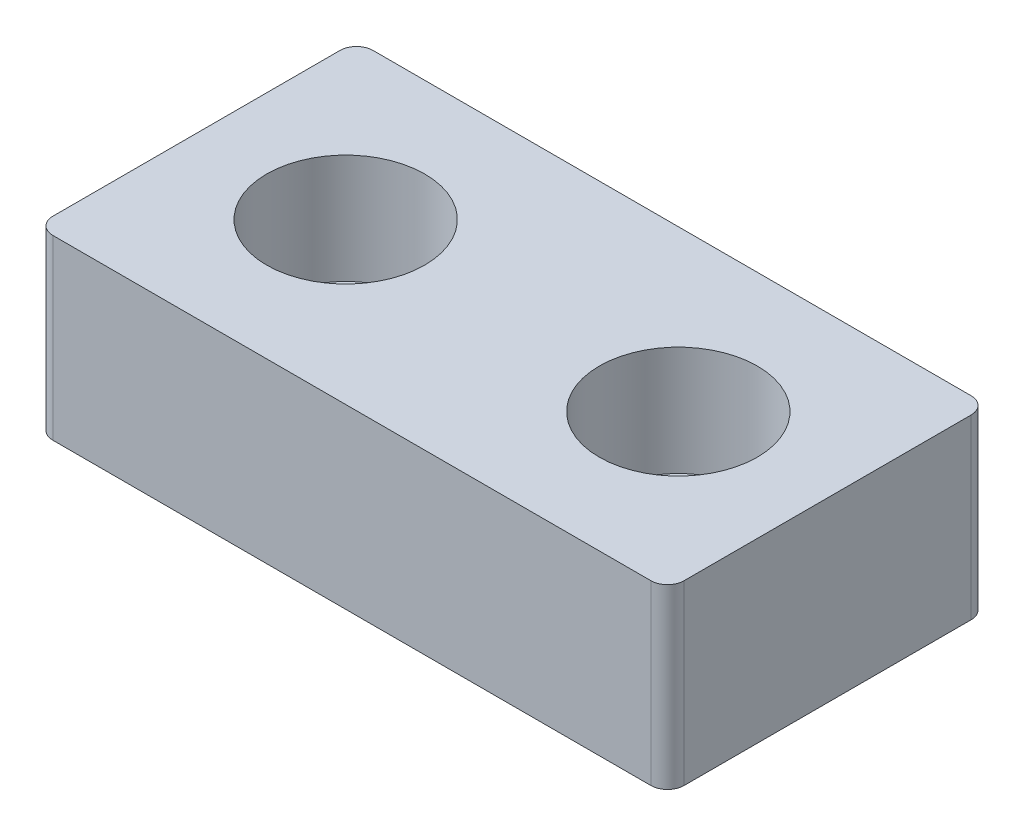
ISO-10303-21;
HEADER;
FILE_DESCRIPTION(('STEP AP214'),'2;1');
FILE_NAME('part.step','',(''),(''),'','','');
FILE_SCHEMA(('AUTOMOTIVE_DESIGN { 1 0 10303 214 1 1 1 1 }'));
ENDSEC;
DATA;
#1=APPLICATION_CONTEXT('core data for automotive mechanical design processes');
#2=APPLICATION_PROTOCOL_DEFINITION('international standard','automotive_design',2000,#1);
#3=PRODUCT_CONTEXT('',#1,'mechanical');
#4=PRODUCT('Part','Part','',(#3));
#5=PRODUCT_RELATED_PRODUCT_CATEGORY('part','',(#4));
#6=PRODUCT_DEFINITION_FORMATION('','',#4);
#7=PRODUCT_DEFINITION_CONTEXT('part definition',#1,'design');
#8=PRODUCT_DEFINITION('design','',#6,#7);
#9=PRODUCT_DEFINITION_SHAPE('','',#8);
#10=(LENGTH_UNIT() NAMED_UNIT(*) SI_UNIT(.MILLI.,.METRE.));
#11=(NAMED_UNIT(*) PLANE_ANGLE_UNIT() SI_UNIT($,.RADIAN.));
#12=(NAMED_UNIT(*) SI_UNIT($,.STERADIAN.) SOLID_ANGLE_UNIT());
#13=UNCERTAINTY_MEASURE_WITH_UNIT(LENGTH_MEASURE(1.E-05),#10,'distance_accuracy_value','');
#14=(GEOMETRIC_REPRESENTATION_CONTEXT(3) GLOBAL_UNCERTAINTY_ASSIGNED_CONTEXT((#13)) GLOBAL_UNIT_ASSIGNED_CONTEXT((#10,
#11,#12)) REPRESENTATION_CONTEXT('',''));
#15=CARTESIAN_POINT('',(0.,0.,0.));
#16=DIRECTION('',(0.,0.,1.));
#17=DIRECTION('',(1.,0.,0.));
#18=AXIS2_PLACEMENT_3D('',#15,#16,#17);
#19=CARTESIAN_POINT('',(-64.646549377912,6.30402599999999,-34.7055606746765));
#20=DIRECTION('',(1.,0.,0.));
#21=DIRECTION('',(0.,0.,-1.));
#22=AXIS2_PLACEMENT_3D('',#19,#20,#21);
#23=PLANE('',#22);
#24=DIRECTION('',(0.,0.,1.));
#25=VECTOR('',#24,1.);
#26=CARTESIAN_POINT('',(-64.646549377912,6.30402599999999,-34.7055606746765));
#27=LINE('',#26,#25);
#28=CARTESIAN_POINT('',(-64.646549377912,6.30402599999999,-48.618835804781));
#29=VERTEX_POINT('',#28);
#30=CARTESIAN_POINT('',(-64.646549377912,6.30402599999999,-35.4675606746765));
#31=VERTEX_POINT('',#30);
#32=EDGE_CURVE('E119',#29,#31,#27,.T.);
#33=ORIENTED_EDGE('',*,*,#32,.F.);
#34=DIRECTION('',(0.,-1.,0.));
#35=VECTOR('',#34,1.);
#36=CARTESIAN_POINT('',(-64.646549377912,6.30402599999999,-48.618835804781));
#37=LINE('',#36,#35);
#38=CARTESIAN_POINT('',(-64.646549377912,-1.82397400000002,-48.618835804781));
#39=VERTEX_POINT('',#38);
#40=EDGE_CURVE('E104',#29,#39,#37,.T.);
#41=ORIENTED_EDGE('',*,*,#40,.T.);
#42=DIRECTION('',(0.,0.,1.));
#43=VECTOR('',#42,1.);
#44=CARTESIAN_POINT('',(-64.646549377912,-1.82397400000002,-34.7055606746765));
#45=LINE('',#44,#43);
#46=CARTESIAN_POINT('',(-64.646549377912,-1.82397400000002,-35.4675606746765));
#47=VERTEX_POINT('',#46);
#48=EDGE_CURVE('E116',#39,#47,#45,.T.);
#49=ORIENTED_EDGE('',*,*,#48,.T.);
#50=DIRECTION('',(0.,-1.,0.));
#51=VECTOR('',#50,1.);
#52=CARTESIAN_POINT('',(-64.646549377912,6.30402599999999,-35.4675606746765));
#53=LINE('',#52,#51);
#54=EDGE_CURVE('E121',#47,#31,#53,.F.);
#55=ORIENTED_EDGE('',*,*,#54,.T.);
#56=EDGE_LOOP('',(#33,#41,#49,#55));
#57=FACE_BOUND('',#56,.T.);
#58=ADVANCED_FACE('F32',(#57),#23,.F.);
#59=CARTESIAN_POINT('',(-35.7234313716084,6.30402599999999,-34.7055606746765));
#60=DIRECTION('',(0.,0.,-1.));
#61=DIRECTION('',(-1.,0.,0.));
#62=AXIS2_PLACEMENT_3D('',#59,#60,#61);
#63=PLANE('',#62);
#64=DIRECTION('',(1.,0.,0.));
#65=VECTOR('',#64,1.);
#66=CARTESIAN_POINT('',(-35.7234313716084,-1.82397400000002,-34.7055606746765));
#67=LINE('',#66,#65);
#68=CARTESIAN_POINT('',(-63.884549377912,-1.82397400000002,-34.7055606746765));
#69=VERTEX_POINT('',#68);
#70=CARTESIAN_POINT('',(-36.4854313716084,-1.82397400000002,-34.7055606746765));
#71=VERTEX_POINT('',#70);
#72=EDGE_CURVE('E125',#69,#71,#67,.T.);
#73=ORIENTED_EDGE('',*,*,#72,.T.);
#74=DIRECTION('',(0.,-1.,0.));
#75=VECTOR('',#74,1.);
#76=CARTESIAN_POINT('',(-36.4854313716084,6.30402599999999,-34.7055606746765));
#77=LINE('',#76,#75);
#78=CARTESIAN_POINT('',(-36.4854313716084,6.30402599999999,-34.7055606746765));
#79=VERTEX_POINT('',#78);
#80=EDGE_CURVE('E11',#71,#79,#77,.F.);
#81=ORIENTED_EDGE('',*,*,#80,.T.);
#82=DIRECTION('',(1.,0.,0.));
#83=VECTOR('',#82,1.);
#84=CARTESIAN_POINT('',(-35.7234313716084,6.30402599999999,-34.7055606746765));
#85=LINE('',#84,#83);
#86=CARTESIAN_POINT('',(-63.884549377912,6.30402599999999,-34.7055606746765));
#87=VERTEX_POINT('',#86);
#88=EDGE_CURVE('E165',#87,#79,#85,.T.);
#89=ORIENTED_EDGE('',*,*,#88,.F.);
#90=DIRECTION('',(0.,-1.,0.));
#91=VECTOR('',#90,1.);
#92=CARTESIAN_POINT('',(-63.884549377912,6.30402599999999,-34.7055606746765));
#93=LINE('',#92,#91);
#94=EDGE_CURVE('E41',#87,#69,#93,.T.);
#95=ORIENTED_EDGE('',*,*,#94,.T.);
#96=EDGE_LOOP('',(#73,#81,#89,#95));
#97=FACE_BOUND('',#96,.T.);
#98=ADVANCED_FACE('F163',(#97),#63,.F.);
#99=CARTESIAN_POINT('',(-35.7234313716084,6.30402599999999,-34.7055606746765));
#100=DIRECTION('',(-1.,0.,0.));
#101=DIRECTION('',(0.,0.,1.));
#102=AXIS2_PLACEMENT_3D('',#99,#100,#101);
#103=PLANE('',#102);
#104=DIRECTION('',(0.,0.,-1.));
#105=VECTOR('',#104,1.);
#106=CARTESIAN_POINT('',(-35.7234313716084,-1.82397400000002,-34.7055606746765));
#107=LINE('',#106,#105);
#108=CARTESIAN_POINT('',(-35.7234313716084,-1.82397400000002,-35.4675606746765));
#109=VERTEX_POINT('',#108);
#110=CARTESIAN_POINT('',(-35.7234313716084,-1.82397400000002,-48.6188358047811));
#111=VERTEX_POINT('',#110);
#112=EDGE_CURVE('E129',#109,#111,#107,.T.);
#113=ORIENTED_EDGE('',*,*,#112,.T.);
#114=DIRECTION('',(0.,-1.,0.));
#115=VECTOR('',#114,1.);
#116=CARTESIAN_POINT('',(-35.7234313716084,6.30402599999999,-48.6188358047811));
#117=LINE('',#116,#115);
#118=CARTESIAN_POINT('',(-35.7234313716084,6.30402599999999,-48.6188358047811));
#119=VERTEX_POINT('',#118);
#120=EDGE_CURVE('E49',#111,#119,#117,.F.);
#121=ORIENTED_EDGE('',*,*,#120,.T.);
#122=DIRECTION('',(0.,0.,-1.));
#123=VECTOR('',#122,1.);
#124=CARTESIAN_POINT('',(-35.7234313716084,6.30402599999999,-34.7055606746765));
#125=LINE('',#124,#123);
#126=CARTESIAN_POINT('',(-35.7234313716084,6.30402599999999,-35.4675606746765));
#127=VERTEX_POINT('',#126);
#128=EDGE_CURVE('E173',#127,#119,#125,.T.);
#129=ORIENTED_EDGE('',*,*,#128,.F.);
#130=DIRECTION('',(0.,-1.,0.));
#131=VECTOR('',#130,1.);
#132=CARTESIAN_POINT('',(-35.7234313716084,6.30402599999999,-35.4675606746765));
#133=LINE('',#132,#131);
#134=EDGE_CURVE('E155',#127,#109,#133,.T.);
#135=ORIENTED_EDGE('',*,*,#134,.T.);
#136=EDGE_LOOP('',(#113,#121,#129,#135));
#137=FACE_BOUND('',#136,.T.);
#138=ADVANCED_FACE('F172',(#137),#103,.F.);
#139=CARTESIAN_POINT('',(-35.7234313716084,6.30402599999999,-49.3808358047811));
#140=DIRECTION('',(0.,0.,1.));
#141=DIRECTION('',(1.,0.,0.));
#142=AXIS2_PLACEMENT_3D('',#139,#140,#141);
#143=PLANE('',#142);
#144=DIRECTION('',(-1.,0.,0.));
#145=VECTOR('',#144,1.);
#146=CARTESIAN_POINT('',(-35.7234313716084,-1.82397400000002,-49.3808358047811));
#147=LINE('',#146,#145);
#148=CARTESIAN_POINT('',(-36.4854313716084,-1.82397400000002,-49.3808358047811));
#149=VERTEX_POINT('',#148);
#150=CARTESIAN_POINT('',(-63.884549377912,-1.82397400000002,-49.380835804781));
#151=VERTEX_POINT('',#150);
#152=EDGE_CURVE('E138',#149,#151,#147,.T.);
#153=ORIENTED_EDGE('',*,*,#152,.T.);
#154=DIRECTION('',(0.,-1.,0.));
#155=VECTOR('',#154,1.);
#156=CARTESIAN_POINT('',(-63.884549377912,6.30402599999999,-49.380835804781));
#157=LINE('',#156,#155);
#158=CARTESIAN_POINT('',(-63.884549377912,6.30402599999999,-49.380835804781));
#159=VERTEX_POINT('',#158);
#160=EDGE_CURVE('E105',#151,#159,#157,.F.);
#161=ORIENTED_EDGE('',*,*,#160,.T.);
#162=DIRECTION('',(-1.,0.,0.));
#163=VECTOR('',#162,1.);
#164=CARTESIAN_POINT('',(-35.7234313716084,6.30402599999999,-49.3808358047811));
#165=LINE('',#164,#163);
#166=CARTESIAN_POINT('',(-36.4854313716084,6.30402599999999,-49.3808358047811));
#167=VERTEX_POINT('',#166);
#168=EDGE_CURVE('E134',#167,#159,#165,.T.);
#169=ORIENTED_EDGE('',*,*,#168,.F.);
#170=DIRECTION('',(0.,-1.,0.));
#171=VECTOR('',#170,1.);
#172=CARTESIAN_POINT('',(-36.4854313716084,6.30402599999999,-49.3808358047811));
#173=LINE('',#172,#171);
#174=EDGE_CURVE('E110',#167,#149,#173,.T.);
#175=ORIENTED_EDGE('',*,*,#174,.T.);
#176=EDGE_LOOP('',(#153,#161,#169,#175));
#177=FACE_BOUND('',#176,.T.);
#178=ADVANCED_FACE('F202',(#177),#143,.F.);
#179=CARTESIAN_POINT('',(0.,6.30402599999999,0.));
#180=DIRECTION('',(0.,1.,0.));
#181=DIRECTION('',(0.,0.,1.));
#182=AXIS2_PLACEMENT_3D('',#179,#180,#181);
#183=PLANE('',#182);
#184=CARTESIAN_POINT('',(-57.8049903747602,6.30402599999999,-42.0431982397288));
#185=DIRECTION('',(0.,1.,0.));
#186=DIRECTION('',(0.,0.,1.));
#187=AXIS2_PLACEMENT_3D('',#184,#185,#186);
#188=CIRCLE('',#187,3.6195);
#189=CARTESIAN_POINT('',(-57.8049903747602,6.30402599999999,-38.4236982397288));
#190=VERTEX_POINT('',#189);
#191=EDGE_CURVE('E193',#190,#190,#188,.T.);
#192=ORIENTED_EDGE('',*,*,#191,.F.);
#193=EDGE_LOOP('',(#192));
#194=FACE_BOUND('',#193,.T.);
#195=CARTESIAN_POINT('',(-42.5649903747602,6.30402599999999,-42.0431982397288));
#196=DIRECTION('',(0.,1.,0.));
#197=DIRECTION('',(0.,0.,1.));
#198=AXIS2_PLACEMENT_3D('',#195,#196,#197);
#199=CIRCLE('',#198,3.6195);
#200=CARTESIAN_POINT('',(-42.5649903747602,6.30402599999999,-38.4236982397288));
#201=VERTEX_POINT('',#200);
#202=EDGE_CURVE('E184',#201,#201,#199,.T.);
#203=ORIENTED_EDGE('',*,*,#202,.F.);
#204=EDGE_LOOP('',(#203));
#205=FACE_BOUND('',#204,.T.);
#206=ORIENTED_EDGE('',*,*,#168,.T.);
#207=CARTESIAN_POINT('',(-63.884549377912,6.30402599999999,-48.618835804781));
#208=DIRECTION('',(0.,1.,0.));
#209=DIRECTION('',(0.,0.,1.));
#210=AXIS2_PLACEMENT_3D('',#207,#208,#209);
#211=CIRCLE('',#210,0.762);
#212=EDGE_CURVE('E153',#159,#29,#211,.T.);
#213=ORIENTED_EDGE('',*,*,#212,.T.);
#214=ORIENTED_EDGE('',*,*,#32,.T.);
#215=CARTESIAN_POINT('',(-63.884549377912,6.30402599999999,-35.4675606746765));
#216=DIRECTION('',(0.,1.,0.));
#217=DIRECTION('',(0.,0.,1.));
#218=AXIS2_PLACEMENT_3D('',#215,#216,#217);
#219=CIRCLE('',#218,0.762);
#220=EDGE_CURVE('E148',#31,#87,#219,.T.);
#221=ORIENTED_EDGE('',*,*,#220,.T.);
#222=ORIENTED_EDGE('',*,*,#88,.T.);
#223=CARTESIAN_POINT('',(-36.4854313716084,6.30402599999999,-35.4675606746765));
#224=DIRECTION('',(0.,1.,0.));
#225=DIRECTION('',(0.,0.,1.));
#226=AXIS2_PLACEMENT_3D('',#223,#224,#225);
#227=CIRCLE('',#226,0.762);
#228=EDGE_CURVE('E56',#79,#127,#227,.T.);
#229=ORIENTED_EDGE('',*,*,#228,.T.);
#230=ORIENTED_EDGE('',*,*,#128,.T.);
#231=CARTESIAN_POINT('',(-36.4854313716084,6.30402599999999,-48.6188358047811));
#232=DIRECTION('',(0.,1.,0.));
#233=DIRECTION('',(0.,0.,1.));
#234=AXIS2_PLACEMENT_3D('',#231,#232,#233);
#235=CIRCLE('',#234,0.762);
#236=EDGE_CURVE('E151',#119,#167,#235,.T.);
#237=ORIENTED_EDGE('',*,*,#236,.T.);
#238=EDGE_LOOP('',(#206,#213,#214,#221,#222,#229,#230,#237));
#239=FACE_BOUND('',#238,.T.);
#240=ADVANCED_FACE('F199',(#194,#205,#239),#183,.T.);
#241=CARTESIAN_POINT('',(0.,-1.82397400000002,0.));
#242=DIRECTION('',(0.,1.,0.));
#243=DIRECTION('',(0.,0.,1.));
#244=AXIS2_PLACEMENT_3D('',#241,#242,#243);
#245=PLANE('',#244);
#246=CARTESIAN_POINT('',(-57.8049903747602,-1.82397400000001,-42.0431982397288));
#247=DIRECTION('',(0.,1.,0.));
#248=DIRECTION('',(0.,0.,1.));
#249=AXIS2_PLACEMENT_3D('',#246,#247,#248);
#250=CIRCLE('',#249,2.15);
#251=CARTESIAN_POINT('',(-57.8049903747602,-1.82397400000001,-39.8931982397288));
#252=VERTEX_POINT('',#251);
#253=EDGE_CURVE('E36',#252,#252,#250,.T.);
#254=ORIENTED_EDGE('',*,*,#253,.T.);
#255=EDGE_LOOP('',(#254));
#256=FACE_BOUND('',#255,.T.);
#257=CARTESIAN_POINT('',(-42.5649903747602,-1.82397400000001,-42.0431982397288));
#258=DIRECTION('',(0.,1.,0.));
#259=DIRECTION('',(0.,0.,1.));
#260=AXIS2_PLACEMENT_3D('',#257,#258,#259);
#261=CIRCLE('',#260,2.15);
#262=CARTESIAN_POINT('',(-42.5649903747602,-1.82397400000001,-39.8931982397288));
#263=VERTEX_POINT('',#262);
#264=EDGE_CURVE('E126',#263,#263,#261,.T.);
#265=ORIENTED_EDGE('',*,*,#264,.T.);
#266=EDGE_LOOP('',(#265));
#267=FACE_BOUND('',#266,.T.);
#268=ORIENTED_EDGE('',*,*,#48,.F.);
#269=CARTESIAN_POINT('',(-63.884549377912,-1.82397400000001,-48.618835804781));
#270=DIRECTION('',(0.,1.,0.));
#271=DIRECTION('',(0.,0.,1.));
#272=AXIS2_PLACEMENT_3D('',#269,#270,#271);
#273=CIRCLE('',#272,0.762);
#274=EDGE_CURVE('E100',#39,#151,#273,.F.);
#275=ORIENTED_EDGE('',*,*,#274,.T.);
#276=ORIENTED_EDGE('',*,*,#152,.F.);
#277=CARTESIAN_POINT('',(-36.4854313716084,-1.82397400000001,-48.6188358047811));
#278=DIRECTION('',(0.,1.,0.));
#279=DIRECTION('',(0.,0.,1.));
#280=AXIS2_PLACEMENT_3D('',#277,#278,#279);
#281=CIRCLE('',#280,0.762);
#282=EDGE_CURVE('E111',#149,#111,#281,.F.);
#283=ORIENTED_EDGE('',*,*,#282,.T.);
#284=ORIENTED_EDGE('',*,*,#112,.F.);
#285=CARTESIAN_POINT('',(-36.4854313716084,-1.82397400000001,-35.4675606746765));
#286=DIRECTION('',(0.,1.,0.));
#287=DIRECTION('',(0.,0.,1.));
#288=AXIS2_PLACEMENT_3D('',#285,#286,#287);
#289=CIRCLE('',#288,0.762);
#290=EDGE_CURVE('E142',#109,#71,#289,.F.);
#291=ORIENTED_EDGE('',*,*,#290,.T.);
#292=ORIENTED_EDGE('',*,*,#72,.F.);
#293=CARTESIAN_POINT('',(-63.884549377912,-1.82397400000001,-35.4675606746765));
#294=DIRECTION('',(0.,1.,0.));
#295=DIRECTION('',(0.,0.,1.));
#296=AXIS2_PLACEMENT_3D('',#293,#294,#295);
#297=CIRCLE('',#296,0.762);
#298=EDGE_CURVE('E120',#69,#47,#297,.F.);
#299=ORIENTED_EDGE('',*,*,#298,.T.);
#300=EDGE_LOOP('',(#268,#275,#276,#283,#284,#291,#292,#299));
#301=FACE_BOUND('',#300,.T.);
#302=ADVANCED_FACE('F123',(#256,#267,#301),#245,.F.);
#303=CARTESIAN_POINT('',(-63.884549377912,6.30402599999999,-48.618835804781));
#304=DIRECTION('',(0.,-1.,0.));
#305=DIRECTION('',(0.,0.,-1.));
#306=AXIS2_PLACEMENT_3D('',#303,#304,#305);
#307=CYLINDRICAL_SURFACE('',#306,0.762);
#308=ORIENTED_EDGE('',*,*,#212,.F.);
#309=ORIENTED_EDGE('',*,*,#160,.F.);
#310=ORIENTED_EDGE('',*,*,#274,.F.);
#311=ORIENTED_EDGE('',*,*,#40,.F.);
#312=EDGE_LOOP('',(#308,#309,#310,#311));
#313=FACE_BOUND('',#312,.T.);
#314=ADVANCED_FACE('F103',(#313),#307,.T.);
#315=CARTESIAN_POINT('',(-36.4854313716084,6.30402599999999,-48.6188358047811));
#316=DIRECTION('',(0.,-1.,0.));
#317=DIRECTION('',(0.,0.,-1.));
#318=AXIS2_PLACEMENT_3D('',#315,#316,#317);
#319=CYLINDRICAL_SURFACE('',#318,0.762);
#320=ORIENTED_EDGE('',*,*,#236,.F.);
#321=ORIENTED_EDGE('',*,*,#120,.F.);
#322=ORIENTED_EDGE('',*,*,#282,.F.);
#323=ORIENTED_EDGE('',*,*,#174,.F.);
#324=EDGE_LOOP('',(#320,#321,#322,#323));
#325=FACE_BOUND('',#324,.T.);
#326=ADVANCED_FACE('F209',(#325),#319,.T.);
#327=CARTESIAN_POINT('',(-36.4854313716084,6.30402599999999,-35.4675606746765));
#328=DIRECTION('',(0.,-1.,0.));
#329=DIRECTION('',(0.,0.,-1.));
#330=AXIS2_PLACEMENT_3D('',#327,#328,#329);
#331=CYLINDRICAL_SURFACE('',#330,0.762);
#332=ORIENTED_EDGE('',*,*,#228,.F.);
#333=ORIENTED_EDGE('',*,*,#80,.F.);
#334=ORIENTED_EDGE('',*,*,#290,.F.);
#335=ORIENTED_EDGE('',*,*,#134,.F.);
#336=EDGE_LOOP('',(#332,#333,#334,#335));
#337=FACE_BOUND('',#336,.T.);
#338=ADVANCED_FACE('F171',(#337),#331,.T.);
#339=CARTESIAN_POINT('',(-63.884549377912,6.30402599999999,-35.4675606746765));
#340=DIRECTION('',(0.,-1.,0.));
#341=DIRECTION('',(0.,0.,-1.));
#342=AXIS2_PLACEMENT_3D('',#339,#340,#341);
#343=CYLINDRICAL_SURFACE('',#342,0.762);
#344=ORIENTED_EDGE('',*,*,#220,.F.);
#345=ORIENTED_EDGE('',*,*,#54,.F.);
#346=ORIENTED_EDGE('',*,*,#298,.F.);
#347=ORIENTED_EDGE('',*,*,#94,.F.);
#348=EDGE_LOOP('',(#344,#345,#346,#347));
#349=FACE_BOUND('',#348,.T.);
#350=ADVANCED_FACE('F34',(#349),#343,.T.);
#351=CARTESIAN_POINT('',(-42.5649903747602,6.30402599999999,-42.0431982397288));
#352=DIRECTION('',(0.,1.,0.));
#353=DIRECTION('',(0.,0.,1.));
#354=AXIS2_PLACEMENT_3D('',#351,#352,#353);
#355=CYLINDRICAL_SURFACE('',#354,2.15);
#356=CARTESIAN_POINT('',(-42.5649903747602,1.28802599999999,-42.0431982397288));
#357=DIRECTION('',(0.,1.,0.));
#358=DIRECTION('',(0.,0.,1.));
#359=AXIS2_PLACEMENT_3D('',#356,#357,#358);
#360=CIRCLE('',#359,2.15);
#361=CARTESIAN_POINT('',(-42.5649903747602,1.28802599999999,-39.8931982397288));
#362=VERTEX_POINT('',#361);
#363=EDGE_CURVE('E132',#362,#362,#360,.T.);
#364=ORIENTED_EDGE('',*,*,#363,.T.);
#365=EDGE_LOOP('',(#364));
#366=FACE_BOUND('',#365,.T.);
#367=ORIENTED_EDGE('',*,*,#264,.F.);
#368=EDGE_LOOP('',(#367));
#369=FACE_BOUND('',#368,.T.);
#370=ADVANCED_FACE('F231',(#366,#369),#355,.F.);
#371=CARTESIAN_POINT('',(-40.4149903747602,1.28802599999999,-42.0431982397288));
#372=DIRECTION('',(0.,-1.,0.));
#373=DIRECTION('',(0.,0.,-1.));
#374=AXIS2_PLACEMENT_3D('',#371,#372,#373);
#375=PLANE('',#374);
#376=ORIENTED_EDGE('',*,*,#363,.F.);
#377=EDGE_LOOP('',(#376));
#378=FACE_BOUND('',#377,.T.);
#379=CARTESIAN_POINT('',(-42.5649903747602,1.28802599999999,-42.0431982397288));
#380=DIRECTION('',(0.,1.,0.));
#381=DIRECTION('',(0.,0.,1.));
#382=AXIS2_PLACEMENT_3D('',#379,#380,#381);
#383=CIRCLE('',#382,3.6195);
#384=CARTESIAN_POINT('',(-42.5649903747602,1.28802599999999,-38.4236982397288));
#385=VERTEX_POINT('',#384);
#386=EDGE_CURVE('E181',#385,#385,#383,.T.);
#387=ORIENTED_EDGE('',*,*,#386,.T.);
#388=EDGE_LOOP('',(#387));
#389=FACE_BOUND('',#388,.T.);
#390=ADVANCED_FACE('F234',(#378,#389),#375,.F.);
#391=CARTESIAN_POINT('',(-42.5649903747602,6.30402599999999,-42.0431982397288));
#392=DIRECTION('',(0.,1.,0.));
#393=DIRECTION('',(0.,0.,1.));
#394=AXIS2_PLACEMENT_3D('',#391,#392,#393);
#395=CYLINDRICAL_SURFACE('',#394,3.6195);
#396=ORIENTED_EDGE('',*,*,#386,.F.);
#397=EDGE_LOOP('',(#396));
#398=FACE_BOUND('',#397,.T.);
#399=ORIENTED_EDGE('',*,*,#202,.T.);
#400=EDGE_LOOP('',(#399));
#401=FACE_BOUND('',#400,.T.);
#402=ADVANCED_FACE('F238',(#398,#401),#395,.F.);
#403=CARTESIAN_POINT('',(-57.8049903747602,6.30402599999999,-42.0431982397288));
#404=DIRECTION('',(0.,1.,0.));
#405=DIRECTION('',(0.,0.,1.));
#406=AXIS2_PLACEMENT_3D('',#403,#404,#405);
#407=CYLINDRICAL_SURFACE('',#406,2.15);
#408=CARTESIAN_POINT('',(-57.8049903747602,1.28802599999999,-42.0431982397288));
#409=DIRECTION('',(0.,1.,0.));
#410=DIRECTION('',(0.,0.,1.));
#411=AXIS2_PLACEMENT_3D('',#408,#409,#410);
#412=CIRCLE('',#411,2.15);
#413=CARTESIAN_POINT('',(-57.8049903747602,1.28802599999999,-39.8931982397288));
#414=VERTEX_POINT('',#413);
#415=EDGE_CURVE('E187',#414,#414,#412,.T.);
#416=ORIENTED_EDGE('',*,*,#415,.T.);
#417=EDGE_LOOP('',(#416));
#418=FACE_BOUND('',#417,.T.);
#419=ORIENTED_EDGE('',*,*,#253,.F.);
#420=EDGE_LOOP('',(#419));
#421=FACE_BOUND('',#420,.T.);
#422=ADVANCED_FACE('F242',(#418,#421),#407,.F.);
#423=CARTESIAN_POINT('',(-55.6549903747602,1.28802599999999,-42.0431982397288));
#424=DIRECTION('',(0.,-1.,0.));
#425=DIRECTION('',(0.,0.,-1.));
#426=AXIS2_PLACEMENT_3D('',#423,#424,#425);
#427=PLANE('',#426);
#428=ORIENTED_EDGE('',*,*,#415,.F.);
#429=EDGE_LOOP('',(#428));
#430=FACE_BOUND('',#429,.T.);
#431=CARTESIAN_POINT('',(-57.8049903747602,1.28802599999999,-42.0431982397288));
#432=DIRECTION('',(0.,1.,0.));
#433=DIRECTION('',(0.,0.,1.));
#434=AXIS2_PLACEMENT_3D('',#431,#432,#433);
#435=CIRCLE('',#434,3.6195);
#436=CARTESIAN_POINT('',(-57.8049903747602,1.28802599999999,-38.4236982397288));
#437=VERTEX_POINT('',#436);
#438=EDGE_CURVE('E190',#437,#437,#435,.T.);
#439=ORIENTED_EDGE('',*,*,#438,.T.);
#440=EDGE_LOOP('',(#439));
#441=FACE_BOUND('',#440,.T.);
#442=ADVANCED_FACE('F246',(#430,#441),#427,.F.);
#443=CARTESIAN_POINT('',(-57.8049903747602,6.30402599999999,-42.0431982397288));
#444=DIRECTION('',(0.,1.,0.));
#445=DIRECTION('',(0.,0.,1.));
#446=AXIS2_PLACEMENT_3D('',#443,#444,#445);
#447=CYLINDRICAL_SURFACE('',#446,3.6195);
#448=ORIENTED_EDGE('',*,*,#438,.F.);
#449=EDGE_LOOP('',(#448));
#450=FACE_BOUND('',#449,.T.);
#451=ORIENTED_EDGE('',*,*,#191,.T.);
#452=EDGE_LOOP('',(#451));
#453=FACE_BOUND('',#452,.T.);
#454=ADVANCED_FACE('F197',(#450,#453),#447,.F.);
#455=CLOSED_SHELL('',(#58,#98,#138,#178,#240,#302,#314,#326,#338,#350,#370,#390,#402,#422,#442,#454));
#456=MANIFOLD_SOLID_BREP('B2',#455);
#457=ADVANCED_BREP_SHAPE_REPRESENTATION('',(#18,#456),#14);
#458=SHAPE_DEFINITION_REPRESENTATION(#9,#457);
ENDSEC;
END-ISO-10303-21;
